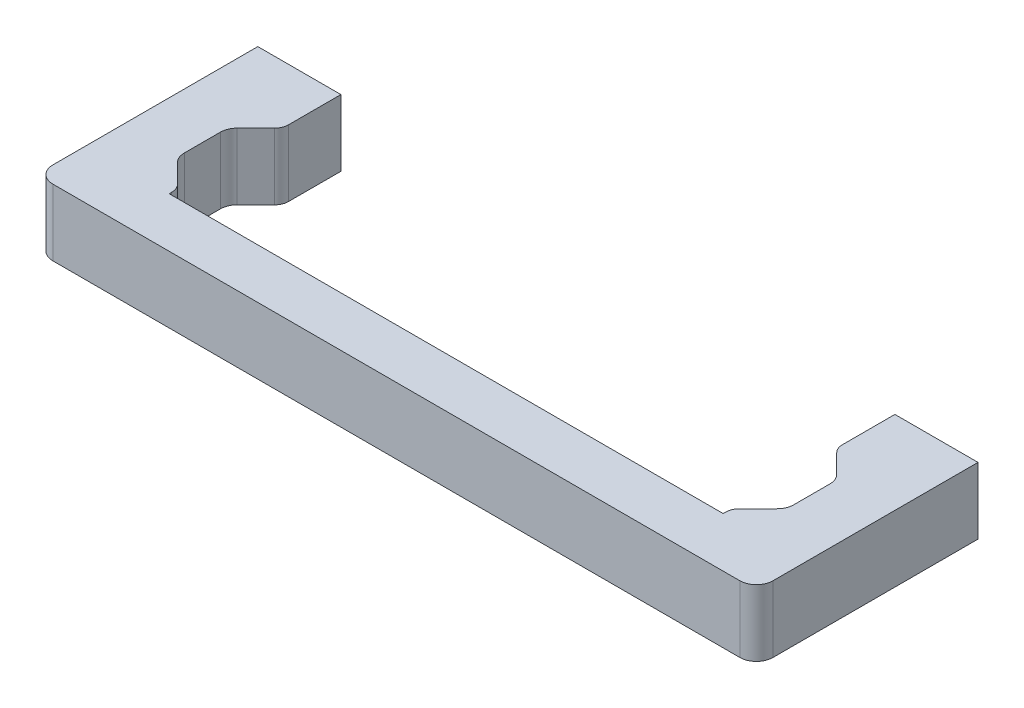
ISO-10303-21;
HEADER;
FILE_DESCRIPTION(('STEP AP214'),'2;1');
FILE_NAME('part.step','',(''),(''),'','','');
FILE_SCHEMA(('AUTOMOTIVE_DESIGN { 1 0 10303 214 1 1 1 1 }'));
ENDSEC;
DATA;
#1=APPLICATION_CONTEXT('core data for automotive mechanical design processes');
#2=APPLICATION_PROTOCOL_DEFINITION('international standard','automotive_design',2000,#1);
#3=PRODUCT_CONTEXT('',#1,'mechanical');
#4=PRODUCT('Part','Part','',(#3));
#5=PRODUCT_RELATED_PRODUCT_CATEGORY('part','',(#4));
#6=PRODUCT_DEFINITION_FORMATION('','',#4);
#7=PRODUCT_DEFINITION_CONTEXT('part definition',#1,'design');
#8=PRODUCT_DEFINITION('design','',#6,#7);
#9=PRODUCT_DEFINITION_SHAPE('','',#8);
#10=(LENGTH_UNIT() NAMED_UNIT(*) SI_UNIT(.MILLI.,.METRE.));
#11=(NAMED_UNIT(*) PLANE_ANGLE_UNIT() SI_UNIT($,.RADIAN.));
#12=(NAMED_UNIT(*) SI_UNIT($,.STERADIAN.) SOLID_ANGLE_UNIT());
#13=UNCERTAINTY_MEASURE_WITH_UNIT(LENGTH_MEASURE(1.E-05),#10,'distance_accuracy_value','');
#14=(GEOMETRIC_REPRESENTATION_CONTEXT(3) GLOBAL_UNCERTAINTY_ASSIGNED_CONTEXT((#13)) GLOBAL_UNIT_ASSIGNED_CONTEXT((#10,
#11,#12)) REPRESENTATION_CONTEXT('',''));
#15=CARTESIAN_POINT('',(0.,0.,0.));
#16=DIRECTION('',(0.,0.,1.));
#17=DIRECTION('',(1.,0.,0.));
#18=AXIS2_PLACEMENT_3D('',#15,#16,#17);
#19=CARTESIAN_POINT('',(-1.99937500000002,-6.,36.998073));
#20=DIRECTION('',(0.,1.,0.));
#21=DIRECTION('',(-1.,0.,0.));
#22=AXIS2_PLACEMENT_3D('',#19,#20,#21);
#23=CYLINDRICAL_SURFACE('',#22,2.999844);
#24=DIRECTION('',(0.,1.,0.));
#25=VECTOR('',#24,1.);
#26=CARTESIAN_POINT('',(-4.999219,-6.,36.998073));
#27=LINE('',#26,#25);
#28=CARTESIAN_POINT('',(-4.999219,-6.,36.998073));
#29=VERTEX_POINT('',#28);
#30=CARTESIAN_POINT('',(-4.999219,6.,36.998073));
#31=VERTEX_POINT('',#30);
#32=EDGE_CURVE('E9',#29,#31,#27,.T.);
#33=ORIENTED_EDGE('',*,*,#32,.F.);
#34=CARTESIAN_POINT('',(-1.99937500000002,-6.,36.998073));
#35=DIRECTION('',(0.,-1.,0.));
#36=DIRECTION('',(1.,0.,0.));
#37=AXIS2_PLACEMENT_3D('',#34,#35,#36);
#38=CIRCLE('',#37,2.999844);
#39=CARTESIAN_POINT('',(-1.99937500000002,-6.,39.997917));
#40=VERTEX_POINT('',#39);
#41=EDGE_CURVE('E277',#40,#29,#38,.T.);
#42=ORIENTED_EDGE('',*,*,#41,.F.);
#43=DIRECTION('',(0.,1.,0.));
#44=VECTOR('',#43,1.);
#45=CARTESIAN_POINT('',(-1.99937500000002,-6.,39.997917));
#46=LINE('',#45,#44);
#47=CARTESIAN_POINT('',(-1.99937500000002,6.,39.997917));
#48=VERTEX_POINT('',#47);
#49=EDGE_CURVE('E29',#40,#48,#46,.T.);
#50=ORIENTED_EDGE('',*,*,#49,.T.);
#51=CARTESIAN_POINT('',(-1.99937500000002,6.,36.998073));
#52=DIRECTION('',(0.,-1.,0.));
#53=DIRECTION('',(1.,0.,0.));
#54=AXIS2_PLACEMENT_3D('',#51,#52,#53);
#55=CIRCLE('',#54,2.999844);
#56=EDGE_CURVE('E197',#48,#31,#55,.T.);
#57=ORIENTED_EDGE('',*,*,#56,.T.);
#58=EDGE_LOOP('',(#33,#42,#50,#57));
#59=FACE_BOUND('',#58,.T.);
#60=ADVANCED_FACE('F14',(#59),#23,.T.);
#61=CARTESIAN_POINT('',(-4.999219,-6.,36.998073));
#62=DIRECTION('',(1.,0.,0.));
#63=DIRECTION('',(0.,1.,0.));
#64=AXIS2_PLACEMENT_3D('',#61,#62,#63);
#65=PLANE('',#64);
#66=DIRECTION('',(0.,1.,0.));
#67=VECTOR('',#66,1.);
#68=CARTESIAN_POINT('',(-4.999219,-6.,0.));
#69=LINE('',#68,#67);
#70=CARTESIAN_POINT('',(-4.999219,-6.,0.));
#71=VERTEX_POINT('',#70);
#72=CARTESIAN_POINT('',(-4.999219,6.,0.));
#73=VERTEX_POINT('',#72);
#74=EDGE_CURVE('E22',#71,#73,#69,.T.);
#75=ORIENTED_EDGE('',*,*,#74,.F.);
#76=DIRECTION('',(0.,0.,-1.));
#77=VECTOR('',#76,1.);
#78=CARTESIAN_POINT('',(-4.999219,-6.,36.998073));
#79=LINE('',#78,#77);
#80=EDGE_CURVE('E193',#29,#71,#79,.T.);
#81=ORIENTED_EDGE('',*,*,#80,.F.);
#82=ORIENTED_EDGE('',*,*,#32,.T.);
#83=DIRECTION('',(0.,0.,-1.));
#84=VECTOR('',#83,1.);
#85=CARTESIAN_POINT('',(-4.999219,6.,36.998073));
#86=LINE('',#85,#84);
#87=EDGE_CURVE('E190',#31,#73,#86,.T.);
#88=ORIENTED_EDGE('',*,*,#87,.T.);
#89=EDGE_LOOP('',(#75,#81,#82,#88));
#90=FACE_BOUND('',#89,.T.);
#91=ADVANCED_FACE('F16',(#90),#65,.F.);
#92=CARTESIAN_POINT('',(-4.999219,-6.,0.));
#93=DIRECTION('',(0.,0.,1.));
#94=DIRECTION('',(0.,-1.,0.));
#95=AXIS2_PLACEMENT_3D('',#92,#93,#94);
#96=PLANE('',#95);
#97=CARTESIAN_POINT('',(0.,0.,0.));
#98=DIRECTION('',(0.,0.,-1.));
#99=DIRECTION('',(0.,1.,0.));
#100=AXIS2_PLACEMENT_3D('',#97,#98,#99);
#101=CIRCLE('',#100,2.5);
#102=CARTESIAN_POINT('',(0.,2.5,0.));
#103=VERTEX_POINT('',#102);
#104=EDGE_CURVE('E763',#103,#103,#101,.T.);
#105=ORIENTED_EDGE('',*,*,#104,.F.);
#106=EDGE_LOOP('',(#105));
#107=FACE_BOUND('',#106,.T.);
#108=DIRECTION('',(0.,1.,0.));
#109=VECTOR('',#108,1.);
#110=CARTESIAN_POINT('',(10.,-6.,0.));
#111=LINE('',#110,#109);
#112=CARTESIAN_POINT('',(10.,-6.,0.));
#113=VERTEX_POINT('',#112);
#114=CARTESIAN_POINT('',(10.,6.,0.));
#115=VERTEX_POINT('',#114);
#116=EDGE_CURVE('E394',#113,#115,#111,.T.);
#117=ORIENTED_EDGE('',*,*,#116,.F.);
#118=DIRECTION('',(1.,0.,0.));
#119=VECTOR('',#118,1.);
#120=CARTESIAN_POINT('',(-4.999219,-6.,0.));
#121=LINE('',#120,#119);
#122=EDGE_CURVE('E280',#71,#113,#121,.T.);
#123=ORIENTED_EDGE('',*,*,#122,.F.);
#124=ORIENTED_EDGE('',*,*,#74,.T.);
#125=DIRECTION('',(1.,0.,0.));
#126=VECTOR('',#125,1.);
#127=CARTESIAN_POINT('',(-4.999219,6.,0.));
#128=LINE('',#127,#126);
#129=EDGE_CURVE('E205',#73,#115,#128,.T.);
#130=ORIENTED_EDGE('',*,*,#129,.T.);
#131=EDGE_LOOP('',(#117,#123,#124,#130));
#132=FACE_BOUND('',#131,.T.);
#133=ADVANCED_FACE('F397',(#107,#132),#96,.F.);
#134=CARTESIAN_POINT('',(10.,-6.,0.));
#135=DIRECTION('',(-1.,0.,0.));
#136=DIRECTION('',(0.,0.,-1.));
#137=AXIS2_PLACEMENT_3D('',#134,#135,#136);
#138=PLANE('',#137);
#139=DIRECTION('',(0.,1.,0.));
#140=VECTOR('',#139,1.);
#141=CARTESIAN_POINT('',(10.,-6.,9.463973));
#142=LINE('',#141,#140);
#143=CARTESIAN_POINT('',(10.,-6.,9.463973));
#144=VERTEX_POINT('',#143);
#145=CARTESIAN_POINT('',(10.,6.,9.463973));
#146=VERTEX_POINT('',#145);
#147=EDGE_CURVE('E392',#144,#146,#142,.T.);
#148=ORIENTED_EDGE('',*,*,#147,.F.);
#149=DIRECTION('',(0.,0.,1.));
#150=VECTOR('',#149,1.);
#151=CARTESIAN_POINT('',(10.,-6.,0.));
#152=LINE('',#151,#150);
#153=EDGE_CURVE('E283',#113,#144,#152,.T.);
#154=ORIENTED_EDGE('',*,*,#153,.F.);
#155=ORIENTED_EDGE('',*,*,#116,.T.);
#156=DIRECTION('',(0.,0.,1.));
#157=VECTOR('',#156,1.);
#158=CARTESIAN_POINT('',(10.,6.,0.));
#159=LINE('',#158,#157);
#160=EDGE_CURVE('E207',#115,#146,#159,.T.);
#161=ORIENTED_EDGE('',*,*,#160,.T.);
#162=EDGE_LOOP('',(#148,#154,#155,#161));
#163=FACE_BOUND('',#162,.T.);
#164=ADVANCED_FACE('F486',(#163),#138,.F.);
#165=CARTESIAN_POINT('',(7.50013,-6.,9.463973));
#166=DIRECTION('',(0.,1.,0.));
#167=DIRECTION('',(-1.,0.,0.));
#168=AXIS2_PLACEMENT_3D('',#165,#166,#167);
#169=CYLINDRICAL_SURFACE('',#168,2.49987);
#170=DIRECTION('',(0.,1.,0.));
#171=VECTOR('',#170,1.);
#172=CARTESIAN_POINT('',(9.26780502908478,-6.,11.2316480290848));
#173=LINE('',#172,#171);
#174=CARTESIAN_POINT('',(9.26780502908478,-6.,11.2316480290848));
#175=VERTEX_POINT('',#174);
#176=CARTESIAN_POINT('',(9.26780502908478,6.,11.2316480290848));
#177=VERTEX_POINT('',#176);
#178=EDGE_CURVE('E390',#175,#177,#173,.T.);
#179=ORIENTED_EDGE('',*,*,#178,.F.);
#180=CARTESIAN_POINT('',(7.50013,-6.,9.463973));
#181=DIRECTION('',(0.,-1.,0.));
#182=DIRECTION('',(1.,0.,0.));
#183=AXIS2_PLACEMENT_3D('',#180,#181,#182);
#184=CIRCLE('',#183,2.49987);
#185=EDGE_CURVE('E286',#144,#175,#184,.T.);
#186=ORIENTED_EDGE('',*,*,#185,.F.);
#187=ORIENTED_EDGE('',*,*,#147,.T.);
#188=CARTESIAN_POINT('',(7.50013,6.,9.463973));
#189=DIRECTION('',(0.,-1.,0.));
#190=DIRECTION('',(1.,0.,0.));
#191=AXIS2_PLACEMENT_3D('',#188,#189,#190);
#192=CIRCLE('',#191,2.49987);
#193=EDGE_CURVE('E213',#146,#177,#192,.T.);
#194=ORIENTED_EDGE('',*,*,#193,.T.);
#195=EDGE_LOOP('',(#179,#186,#187,#194));
#196=FACE_BOUND('',#195,.T.);
#197=ADVANCED_FACE('F484',(#196),#169,.T.);
#198=CARTESIAN_POINT('',(5.87889396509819,-6.,14.6205589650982));
#199=DIRECTION('',(0.707106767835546,0.,0.707106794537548));
#200=DIRECTION('',(-0.707106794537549,0.,0.707106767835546));
#201=AXIS2_PLACEMENT_3D('',#198,#199,#200);
#202=PLANE('',#201);
#203=DIRECTION('',(0.,1.,0.));
#204=VECTOR('',#203,1.);
#205=CARTESIAN_POINT('',(5.87889396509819,-6.,14.6205589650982));
#206=LINE('',#205,#204);
#207=CARTESIAN_POINT('',(5.87889396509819,-6.,14.6205589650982));
#208=VERTEX_POINT('',#207);
#209=CARTESIAN_POINT('',(5.87889396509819,6.,14.6205589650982));
#210=VERTEX_POINT('',#209);
#211=EDGE_CURVE('E388',#208,#210,#206,.T.);
#212=ORIENTED_EDGE('',*,*,#211,.F.);
#213=DIRECTION('',(0.707106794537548,0.,-0.707106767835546));
#214=VECTOR('',#213,1.);
#215=CARTESIAN_POINT('',(5.87889396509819,-6.,14.6205589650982));
#216=LINE('',#215,#214);
#217=EDGE_CURVE('E289',#208,#175,#216,.T.);
#218=ORIENTED_EDGE('',*,*,#217,.T.);
#219=ORIENTED_EDGE('',*,*,#178,.T.);
#220=DIRECTION('',(0.707106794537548,0.,-0.707106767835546));
#221=VECTOR('',#220,1.);
#222=CARTESIAN_POINT('',(5.87889396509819,6.,14.6205589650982));
#223=LINE('',#222,#221);
#224=EDGE_CURVE('E216',#210,#177,#223,.T.);
#225=ORIENTED_EDGE('',*,*,#224,.F.);
#226=EDGE_LOOP('',(#212,#218,#219,#225));
#227=FACE_BOUND('',#226,.T.);
#228=ADVANCED_FACE('F480',(#227),#202,.T.);
#229=CARTESIAN_POINT('',(8.000104,-6.,16.741769));
#230=DIRECTION('',(0.,1.,0.));
#231=DIRECTION('',(-1.,0.,0.));
#232=AXIS2_PLACEMENT_3D('',#229,#230,#231);
#233=CYLINDRICAL_SURFACE('',#232,2.999844);
#234=DIRECTION('',(0.,1.,0.));
#235=VECTOR('',#234,1.);
#236=CARTESIAN_POINT('',(5.00026,-6.,16.741769));
#237=LINE('',#236,#235);
#238=CARTESIAN_POINT('',(5.00026,-6.,16.741769));
#239=VERTEX_POINT('',#238);
#240=CARTESIAN_POINT('',(5.00026,6.,16.741769));
#241=VERTEX_POINT('',#240);
#242=EDGE_CURVE('E386',#239,#241,#237,.T.);
#243=ORIENTED_EDGE('',*,*,#242,.F.);
#244=CARTESIAN_POINT('',(8.000104,-6.,16.741769));
#245=DIRECTION('',(0.,-1.,0.));
#246=DIRECTION('',(1.,0.,0.));
#247=AXIS2_PLACEMENT_3D('',#244,#245,#246);
#248=CIRCLE('',#247,2.999844);
#249=EDGE_CURVE('E292',#239,#208,#248,.T.);
#250=ORIENTED_EDGE('',*,*,#249,.T.);
#251=ORIENTED_EDGE('',*,*,#211,.T.);
#252=CARTESIAN_POINT('',(8.000104,6.,16.741769));
#253=DIRECTION('',(0.,-1.,0.));
#254=DIRECTION('',(1.,0.,0.));
#255=AXIS2_PLACEMENT_3D('',#252,#253,#254);
#256=CIRCLE('',#255,2.999844);
#257=EDGE_CURVE('E219',#241,#210,#256,.T.);
#258=ORIENTED_EDGE('',*,*,#257,.F.);
#259=EDGE_LOOP('',(#243,#250,#251,#258));
#260=FACE_BOUND('',#259,.T.);
#261=ADVANCED_FACE('F476',(#260),#233,.F.);
#262=CARTESIAN_POINT('',(5.00026,-6.,23.256148));
#263=DIRECTION('',(1.,0.,0.));
#264=DIRECTION('',(0.,1.,0.));
#265=AXIS2_PLACEMENT_3D('',#262,#263,#264);
#266=PLANE('',#265);
#267=DIRECTION('',(0.,1.,0.));
#268=VECTOR('',#267,1.);
#269=CARTESIAN_POINT('',(5.00026,-6.,23.256148));
#270=LINE('',#269,#268);
#271=CARTESIAN_POINT('',(5.00026,-6.,23.256148));
#272=VERTEX_POINT('',#271);
#273=CARTESIAN_POINT('',(5.00026,6.,23.256148));
#274=VERTEX_POINT('',#273);
#275=EDGE_CURVE('E384',#272,#274,#270,.T.);
#276=ORIENTED_EDGE('',*,*,#275,.F.);
#277=DIRECTION('',(0.,0.,-1.));
#278=VECTOR('',#277,1.);
#279=CARTESIAN_POINT('',(5.00026,-6.,23.256148));
#280=LINE('',#279,#278);
#281=EDGE_CURVE('E295',#272,#239,#280,.T.);
#282=ORIENTED_EDGE('',*,*,#281,.T.);
#283=ORIENTED_EDGE('',*,*,#242,.T.);
#284=DIRECTION('',(0.,0.,-1.));
#285=VECTOR('',#284,1.);
#286=CARTESIAN_POINT('',(5.00026,6.,23.256148));
#287=LINE('',#286,#285);
#288=EDGE_CURVE('E222',#274,#241,#287,.T.);
#289=ORIENTED_EDGE('',*,*,#288,.F.);
#290=EDGE_LOOP('',(#276,#282,#283,#289));
#291=FACE_BOUND('',#290,.T.);
#292=ADVANCED_FACE('F472',(#291),#266,.T.);
#293=CARTESIAN_POINT('',(8.000104,-6.,23.256148));
#294=DIRECTION('',(0.,1.,0.));
#295=DIRECTION('',(-1.,0.,0.));
#296=AXIS2_PLACEMENT_3D('',#293,#294,#295);
#297=CYLINDRICAL_SURFACE('',#296,2.999844);
#298=DIRECTION('',(0.,1.,0.));
#299=VECTOR('',#298,1.);
#300=CARTESIAN_POINT('',(5.87889396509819,-6.,25.3773580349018));
#301=LINE('',#300,#299);
#302=CARTESIAN_POINT('',(5.87889396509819,-6.,25.3773580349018));
#303=VERTEX_POINT('',#302);
#304=CARTESIAN_POINT('',(5.87889396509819,6.,25.3773580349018));
#305=VERTEX_POINT('',#304);
#306=EDGE_CURVE('E382',#303,#305,#301,.T.);
#307=ORIENTED_EDGE('',*,*,#306,.F.);
#308=CARTESIAN_POINT('',(8.000104,-6.,23.256148));
#309=DIRECTION('',(0.,-1.,0.));
#310=DIRECTION('',(1.,0.,0.));
#311=AXIS2_PLACEMENT_3D('',#308,#309,#310);
#312=CIRCLE('',#311,2.999844);
#313=EDGE_CURVE('E298',#303,#272,#312,.T.);
#314=ORIENTED_EDGE('',*,*,#313,.T.);
#315=ORIENTED_EDGE('',*,*,#275,.T.);
#316=CARTESIAN_POINT('',(8.000104,6.,23.256148));
#317=DIRECTION('',(0.,-1.,0.));
#318=DIRECTION('',(1.,0.,0.));
#319=AXIS2_PLACEMENT_3D('',#316,#317,#318);
#320=CIRCLE('',#319,2.999844);
#321=EDGE_CURVE('E225',#305,#274,#320,.T.);
#322=ORIENTED_EDGE('',*,*,#321,.F.);
#323=EDGE_LOOP('',(#307,#314,#315,#322));
#324=FACE_BOUND('',#323,.T.);
#325=ADVANCED_FACE('F468',(#324),#297,.F.);
#326=CARTESIAN_POINT('',(5.87889396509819,-6.,25.3773580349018));
#327=DIRECTION('',(-0.707106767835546,0.,0.707106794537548));
#328=DIRECTION('',(-0.707106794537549,0.,-0.707106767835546));
#329=AXIS2_PLACEMENT_3D('',#326,#327,#328);
#330=PLANE('',#329);
#331=DIRECTION('',(0.,1.,0.));
#332=VECTOR('',#331,1.);
#333=CARTESIAN_POINT('',(9.26780502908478,-6.,28.7662689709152));
#334=LINE('',#333,#332);
#335=CARTESIAN_POINT('',(9.26780502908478,-6.,28.7662689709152));
#336=VERTEX_POINT('',#335);
#337=CARTESIAN_POINT('',(9.26780502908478,6.,28.7662689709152));
#338=VERTEX_POINT('',#337);
#339=EDGE_CURVE('E380',#336,#338,#334,.T.);
#340=ORIENTED_EDGE('',*,*,#339,.F.);
#341=DIRECTION('',(0.707106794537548,0.,0.707106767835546));
#342=VECTOR('',#341,1.);
#343=CARTESIAN_POINT('',(5.87889396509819,-6.,25.3773580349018));
#344=LINE('',#343,#342);
#345=EDGE_CURVE('E301',#303,#336,#344,.T.);
#346=ORIENTED_EDGE('',*,*,#345,.F.);
#347=ORIENTED_EDGE('',*,*,#306,.T.);
#348=DIRECTION('',(0.707106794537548,0.,0.707106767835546));
#349=VECTOR('',#348,1.);
#350=CARTESIAN_POINT('',(5.87889396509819,6.,25.3773580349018));
#351=LINE('',#350,#349);
#352=EDGE_CURVE('E228',#305,#338,#351,.T.);
#353=ORIENTED_EDGE('',*,*,#352,.T.);
#354=EDGE_LOOP('',(#340,#346,#347,#353));
#355=FACE_BOUND('',#354,.T.);
#356=ADVANCED_FACE('F464',(#355),#330,.F.);
#357=CARTESIAN_POINT('',(7.50013,-6.,30.533944));
#358=DIRECTION('',(0.,1.,0.));
#359=DIRECTION('',(-1.,0.,0.));
#360=AXIS2_PLACEMENT_3D('',#357,#358,#359);
#361=CYLINDRICAL_SURFACE('',#360,2.49987);
#362=DIRECTION('',(0.,1.,0.));
#363=VECTOR('',#362,1.);
#364=CARTESIAN_POINT('',(10.,-6.,30.533944));
#365=LINE('',#364,#363);
#366=CARTESIAN_POINT('',(10.,-6.,30.533944));
#367=VERTEX_POINT('',#366);
#368=CARTESIAN_POINT('',(10.,6.,30.533944));
#369=VERTEX_POINT('',#368);
#370=EDGE_CURVE('E378',#367,#369,#365,.T.);
#371=ORIENTED_EDGE('',*,*,#370,.F.);
#372=CARTESIAN_POINT('',(7.50013,-6.,30.533944));
#373=DIRECTION('',(0.,-1.,0.));
#374=DIRECTION('',(1.,0.,0.));
#375=AXIS2_PLACEMENT_3D('',#372,#373,#374);
#376=CIRCLE('',#375,2.49987);
#377=EDGE_CURVE('E304',#336,#367,#376,.T.);
#378=ORIENTED_EDGE('',*,*,#377,.F.);
#379=ORIENTED_EDGE('',*,*,#339,.T.);
#380=CARTESIAN_POINT('',(7.50013,6.,30.533944));
#381=DIRECTION('',(0.,-1.,0.));
#382=DIRECTION('',(1.,0.,0.));
#383=AXIS2_PLACEMENT_3D('',#380,#381,#382);
#384=CIRCLE('',#383,2.49987);
#385=EDGE_CURVE('E231',#338,#369,#384,.T.);
#386=ORIENTED_EDGE('',*,*,#385,.T.);
#387=EDGE_LOOP('',(#371,#378,#379,#386));
#388=FACE_BOUND('',#387,.T.);
#389=ADVANCED_FACE('F461',(#388),#361,.T.);
#390=CARTESIAN_POINT('',(10.,-6.,30.533944));
#391=DIRECTION('',(-1.,0.,0.));
#392=DIRECTION('',(0.,0.,-1.));
#393=AXIS2_PLACEMENT_3D('',#390,#391,#392);
#394=PLANE('',#393);
#395=DIRECTION('',(0.,1.,0.));
#396=VECTOR('',#395,1.);
#397=CARTESIAN_POINT('',(10.,-6.,30.998386));
#398=LINE('',#397,#396);
#399=CARTESIAN_POINT('',(10.,-6.,30.998386));
#400=VERTEX_POINT('',#399);
#401=CARTESIAN_POINT('',(10.,6.,30.998386));
#402=VERTEX_POINT('',#401);
#403=EDGE_CURVE('E376',#400,#402,#398,.T.);
#404=ORIENTED_EDGE('',*,*,#403,.F.);
#405=DIRECTION('',(0.,0.,1.));
#406=VECTOR('',#405,1.);
#407=CARTESIAN_POINT('',(10.,-6.,30.533944));
#408=LINE('',#407,#406);
#409=EDGE_CURVE('E307',#367,#400,#408,.T.);
#410=ORIENTED_EDGE('',*,*,#409,.F.);
#411=ORIENTED_EDGE('',*,*,#370,.T.);
#412=DIRECTION('',(0.,0.,1.));
#413=VECTOR('',#412,1.);
#414=CARTESIAN_POINT('',(10.,6.,30.533944));
#415=LINE('',#414,#413);
#416=EDGE_CURVE('E234',#369,#402,#415,.T.);
#417=ORIENTED_EDGE('',*,*,#416,.T.);
#418=EDGE_LOOP('',(#404,#410,#411,#417));
#419=FACE_BOUND('',#418,.T.);
#420=ADVANCED_FACE('F457',(#419),#394,.F.);
#421=CARTESIAN_POINT('',(10.,-6.,30.998386));
#422=DIRECTION('',(0.,0.,1.));
#423=DIRECTION('',(0.,-1.,0.));
#424=AXIS2_PLACEMENT_3D('',#421,#422,#423);
#425=PLANE('',#424);
#426=DIRECTION('',(0.,1.,0.));
#427=VECTOR('',#426,1.);
#428=CARTESIAN_POINT('',(110.001562,-6.,30.998386));
#429=LINE('',#428,#427);
#430=CARTESIAN_POINT('',(110.001562,-6.,30.998386));
#431=VERTEX_POINT('',#430);
#432=CARTESIAN_POINT('',(110.001562,6.,30.998386));
#433=VERTEX_POINT('',#432);
#434=EDGE_CURVE('E374',#431,#433,#429,.T.);
#435=ORIENTED_EDGE('',*,*,#434,.F.);
#436=DIRECTION('',(1.,0.,0.));
#437=VECTOR('',#436,1.);
#438=CARTESIAN_POINT('',(10.,-6.,30.998386));
#439=LINE('',#438,#437);
#440=EDGE_CURVE('E310',#400,#431,#439,.T.);
#441=ORIENTED_EDGE('',*,*,#440,.F.);
#442=ORIENTED_EDGE('',*,*,#403,.T.);
#443=DIRECTION('',(1.,0.,0.));
#444=VECTOR('',#443,1.);
#445=CARTESIAN_POINT('',(10.,6.,30.998386));
#446=LINE('',#445,#444);
#447=EDGE_CURVE('E237',#402,#433,#446,.T.);
#448=ORIENTED_EDGE('',*,*,#447,.T.);
#449=EDGE_LOOP('',(#435,#441,#442,#448));
#450=FACE_BOUND('',#449,.T.);
#451=ADVANCED_FACE('F452',(#450),#425,.F.);
#452=CARTESIAN_POINT('',(110.001562,-6.,30.533944));
#453=DIRECTION('',(-1.,0.,0.));
#454=DIRECTION('',(0.,-1.,0.));
#455=AXIS2_PLACEMENT_3D('',#452,#453,#454);
#456=PLANE('',#455);
#457=DIRECTION('',(0.,1.,0.));
#458=VECTOR('',#457,1.);
#459=CARTESIAN_POINT('',(110.001562,-6.,30.533944));
#460=LINE('',#459,#458);
#461=CARTESIAN_POINT('',(110.001562,-6.,30.533944));
#462=VERTEX_POINT('',#461);
#463=CARTESIAN_POINT('',(110.001562,6.,30.533944));
#464=VERTEX_POINT('',#463);
#465=EDGE_CURVE('E372',#462,#464,#460,.T.);
#466=ORIENTED_EDGE('',*,*,#465,.F.);
#467=DIRECTION('',(0.,0.,1.));
#468=VECTOR('',#467,1.);
#469=CARTESIAN_POINT('',(110.001562,-6.,30.533944));
#470=LINE('',#469,#468);
#471=EDGE_CURVE('E313',#462,#431,#470,.T.);
#472=ORIENTED_EDGE('',*,*,#471,.T.);
#473=ORIENTED_EDGE('',*,*,#434,.T.);
#474=DIRECTION('',(0.,0.,1.));
#475=VECTOR('',#474,1.);
#476=CARTESIAN_POINT('',(110.001562,6.,30.533944));
#477=LINE('',#476,#475);
#478=EDGE_CURVE('E240',#464,#433,#477,.T.);
#479=ORIENTED_EDGE('',*,*,#478,.F.);
#480=EDGE_LOOP('',(#466,#472,#473,#479));
#481=FACE_BOUND('',#480,.T.);
#482=ADVANCED_FACE('F449',(#481),#456,.T.);
#483=CARTESIAN_POINT('',(112.501432,-6.,30.533944));
#484=DIRECTION('',(0.,1.,0.));
#485=DIRECTION('',(-1.,0.,0.));
#486=AXIS2_PLACEMENT_3D('',#483,#484,#485);
#487=CYLINDRICAL_SURFACE('',#486,2.49986997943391);
#488=DIRECTION('',(0.,1.,0.));
#489=VECTOR('',#488,1.);
#490=CARTESIAN_POINT('',(110.733756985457,-6.,28.7662689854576));
#491=LINE('',#490,#489);
#492=CARTESIAN_POINT('',(110.733756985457,-6.,28.7662689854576));
#493=VERTEX_POINT('',#492);
#494=CARTESIAN_POINT('',(110.733756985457,6.,28.7662689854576));
#495=VERTEX_POINT('',#494);
#496=EDGE_CURVE('E370',#493,#495,#491,.T.);
#497=ORIENTED_EDGE('',*,*,#496,.F.);
#498=CARTESIAN_POINT('',(112.501432,-6.,30.533944));
#499=DIRECTION('',(0.,-1.,0.));
#500=DIRECTION('',(1.,0.,0.));
#501=AXIS2_PLACEMENT_3D('',#498,#499,#500);
#502=CIRCLE('',#501,2.49986997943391);
#503=EDGE_CURVE('E316',#462,#493,#502,.T.);
#504=ORIENTED_EDGE('',*,*,#503,.F.);
#505=ORIENTED_EDGE('',*,*,#465,.T.);
#506=CARTESIAN_POINT('',(112.501432,6.,30.533944));
#507=DIRECTION('',(0.,-1.,0.));
#508=DIRECTION('',(1.,0.,0.));
#509=AXIS2_PLACEMENT_3D('',#506,#507,#508);
#510=CIRCLE('',#509,2.49986997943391);
#511=EDGE_CURVE('E243',#464,#495,#510,.T.);
#512=ORIENTED_EDGE('',*,*,#511,.T.);
#513=EDGE_LOOP('',(#497,#504,#505,#512));
#514=FACE_BOUND('',#513,.T.);
#515=ADVANCED_FACE('F445',(#514),#487,.T.);
#516=CARTESIAN_POINT('',(114.122668,-6.,25.377358));
#517=DIRECTION('',(-0.707106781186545,0.,-0.70710678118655));
#518=DIRECTION('',(0.707106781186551,0.,-0.707106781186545));
#519=AXIS2_PLACEMENT_3D('',#516,#517,#518);
#520=PLANE('',#519);
#521=DIRECTION('',(0.,1.,0.));
#522=VECTOR('',#521,1.);
#523=CARTESIAN_POINT('',(114.122668,-6.,25.377358));
#524=LINE('',#523,#522);
#525=CARTESIAN_POINT('',(114.122668,-6.,25.377358));
#526=VERTEX_POINT('',#525);
#527=CARTESIAN_POINT('',(114.122668,6.,25.377358));
#528=VERTEX_POINT('',#527);
#529=EDGE_CURVE('E368',#526,#528,#524,.T.);
#530=ORIENTED_EDGE('',*,*,#529,.F.);
#531=DIRECTION('',(-0.707106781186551,0.,0.707106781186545));
#532=VECTOR('',#531,1.);
#533=CARTESIAN_POINT('',(114.122668,-6.,25.377358));
#534=LINE('',#533,#532);
#535=EDGE_CURVE('E319',#526,#493,#534,.T.);
#536=ORIENTED_EDGE('',*,*,#535,.T.);
#537=ORIENTED_EDGE('',*,*,#496,.T.);
#538=DIRECTION('',(-0.707106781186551,0.,0.707106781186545));
#539=VECTOR('',#538,1.);
#540=CARTESIAN_POINT('',(114.122668,6.,25.377358));
#541=LINE('',#540,#539);
#542=EDGE_CURVE('E246',#528,#495,#541,.T.);
#543=ORIENTED_EDGE('',*,*,#542,.F.);
#544=EDGE_LOOP('',(#530,#536,#537,#543));
#545=FACE_BOUND('',#544,.T.);
#546=ADVANCED_FACE('F440',(#545),#520,.T.);
#547=CARTESIAN_POINT('',(112.001458,-6.,23.256148));
#548=DIRECTION('',(0.,1.,0.));
#549=DIRECTION('',(-1.,0.,0.));
#550=AXIS2_PLACEMENT_3D('',#547,#548,#549);
#551=CYLINDRICAL_SURFACE('',#550,2.99984397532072);
#552=DIRECTION('',(0.,1.,0.));
#553=VECTOR('',#552,1.);
#554=CARTESIAN_POINT('',(115.001301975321,-6.,23.256148));
#555=LINE('',#554,#553);
#556=CARTESIAN_POINT('',(115.001301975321,-6.,23.256148));
#557=VERTEX_POINT('',#556);
#558=CARTESIAN_POINT('',(115.001301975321,6.,23.256148));
#559=VERTEX_POINT('',#558);
#560=EDGE_CURVE('E366',#557,#559,#555,.T.);
#561=ORIENTED_EDGE('',*,*,#560,.F.);
#562=CARTESIAN_POINT('',(112.001458,-6.,23.256148));
#563=DIRECTION('',(0.,-1.,0.));
#564=DIRECTION('',(1.,0.,0.));
#565=AXIS2_PLACEMENT_3D('',#562,#563,#564);
#566=CIRCLE('',#565,2.99984397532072);
#567=EDGE_CURVE('E322',#557,#526,#566,.T.);
#568=ORIENTED_EDGE('',*,*,#567,.T.);
#569=ORIENTED_EDGE('',*,*,#529,.T.);
#570=CARTESIAN_POINT('',(112.001458,6.,23.256148));
#571=DIRECTION('',(0.,-1.,0.));
#572=DIRECTION('',(1.,0.,0.));
#573=AXIS2_PLACEMENT_3D('',#570,#571,#572);
#574=CIRCLE('',#573,2.99984397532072);
#575=EDGE_CURVE('E249',#559,#528,#574,.T.);
#576=ORIENTED_EDGE('',*,*,#575,.F.);
#577=EDGE_LOOP('',(#561,#568,#569,#576));
#578=FACE_BOUND('',#577,.T.);
#579=ADVANCED_FACE('F436',(#578),#551,.F.);
#580=CARTESIAN_POINT('',(115.001302,-6.,23.256148));
#581=DIRECTION('',(1.,0.,0.));
#582=DIRECTION('',(0.,1.,0.));
#583=AXIS2_PLACEMENT_3D('',#580,#581,#582);
#584=PLANE('',#583);
#585=DIRECTION('',(0.,1.,0.));
#586=VECTOR('',#585,1.);
#587=CARTESIAN_POINT('',(115.001302,-6.,16.741769));
#588=LINE('',#587,#586);
#589=CARTESIAN_POINT('',(115.001302,-6.,16.741769));
#590=VERTEX_POINT('',#589);
#591=CARTESIAN_POINT('',(115.001302,6.,16.741769));
#592=VERTEX_POINT('',#591);
#593=EDGE_CURVE('E364',#590,#592,#588,.T.);
#594=ORIENTED_EDGE('',*,*,#593,.F.);
#595=DIRECTION('',(0.,0.,-1.));
#596=VECTOR('',#595,1.);
#597=CARTESIAN_POINT('',(115.001302,-6.,23.256148));
#598=LINE('',#597,#596);
#599=EDGE_CURVE('E325',#557,#590,#598,.T.);
#600=ORIENTED_EDGE('',*,*,#599,.F.);
#601=ORIENTED_EDGE('',*,*,#560,.T.);
#602=DIRECTION('',(0.,0.,-1.));
#603=VECTOR('',#602,1.);
#604=CARTESIAN_POINT('',(115.001302,6.,23.256148));
#605=LINE('',#604,#603);
#606=EDGE_CURVE('E252',#559,#592,#605,.T.);
#607=ORIENTED_EDGE('',*,*,#606,.T.);
#608=EDGE_LOOP('',(#594,#600,#601,#607));
#609=FACE_BOUND('',#608,.T.);
#610=ADVANCED_FACE('F432',(#609),#584,.F.);
#611=CARTESIAN_POINT('',(112.001458,-6.,16.741769));
#612=DIRECTION('',(0.,1.,0.));
#613=DIRECTION('',(-1.,0.,0.));
#614=AXIS2_PLACEMENT_3D('',#611,#612,#613);
#615=CYLINDRICAL_SURFACE('',#614,2.99984397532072);
#616=DIRECTION('',(0.,1.,0.));
#617=VECTOR('',#616,1.);
#618=CARTESIAN_POINT('',(114.122668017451,-6.,14.620558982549));
#619=LINE('',#618,#617);
#620=CARTESIAN_POINT('',(114.122668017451,-6.,14.620558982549));
#621=VERTEX_POINT('',#620);
#622=CARTESIAN_POINT('',(114.122668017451,6.,14.620558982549));
#623=VERTEX_POINT('',#622);
#624=EDGE_CURVE('E362',#621,#623,#619,.T.);
#625=ORIENTED_EDGE('',*,*,#624,.F.);
#626=CARTESIAN_POINT('',(112.001458,-6.,16.741769));
#627=DIRECTION('',(0.,-1.,0.));
#628=DIRECTION('',(1.,0.,0.));
#629=AXIS2_PLACEMENT_3D('',#626,#627,#628);
#630=CIRCLE('',#629,2.99984397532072);
#631=EDGE_CURVE('E328',#621,#590,#630,.T.);
#632=ORIENTED_EDGE('',*,*,#631,.T.);
#633=ORIENTED_EDGE('',*,*,#593,.T.);
#634=CARTESIAN_POINT('',(112.001458,6.,16.741769));
#635=DIRECTION('',(0.,-1.,0.));
#636=DIRECTION('',(1.,0.,0.));
#637=AXIS2_PLACEMENT_3D('',#634,#635,#636);
#638=CIRCLE('',#637,2.99984397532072);
#639=EDGE_CURVE('E255',#623,#592,#638,.T.);
#640=ORIENTED_EDGE('',*,*,#639,.F.);
#641=EDGE_LOOP('',(#625,#632,#633,#640));
#642=FACE_BOUND('',#641,.T.);
#643=ADVANCED_FACE('F428',(#642),#615,.F.);
#644=CARTESIAN_POINT('',(114.122668,-6.,14.620559));
#645=DIRECTION('',(0.707106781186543,0.,-0.707106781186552));
#646=DIRECTION('',(0.707106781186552,0.,0.707106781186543));
#647=AXIS2_PLACEMENT_3D('',#644,#645,#646);
#648=PLANE('',#647);
#649=DIRECTION('',(0.,1.,0.));
#650=VECTOR('',#649,1.);
#651=CARTESIAN_POINT('',(110.733757,-6.,11.231648));
#652=LINE('',#651,#650);
#653=CARTESIAN_POINT('',(110.733757,-6.,11.231648));
#654=VERTEX_POINT('',#653);
#655=CARTESIAN_POINT('',(110.733757,6.,11.231648));
#656=VERTEX_POINT('',#655);
#657=EDGE_CURVE('E360',#654,#656,#652,.T.);
#658=ORIENTED_EDGE('',*,*,#657,.F.);
#659=DIRECTION('',(-0.707106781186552,0.,-0.707106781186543));
#660=VECTOR('',#659,1.);
#661=CARTESIAN_POINT('',(114.122668,-6.,14.620559));
#662=LINE('',#661,#660);
#663=EDGE_CURVE('E331',#621,#654,#662,.T.);
#664=ORIENTED_EDGE('',*,*,#663,.F.);
#665=ORIENTED_EDGE('',*,*,#624,.T.);
#666=DIRECTION('',(-0.707106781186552,0.,-0.707106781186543));
#667=VECTOR('',#666,1.);
#668=CARTESIAN_POINT('',(114.122668,6.,14.620559));
#669=LINE('',#668,#667);
#670=EDGE_CURVE('E258',#623,#656,#669,.T.);
#671=ORIENTED_EDGE('',*,*,#670,.T.);
#672=EDGE_LOOP('',(#658,#664,#665,#671));
#673=FACE_BOUND('',#672,.T.);
#674=ADVANCED_FACE('F424',(#673),#648,.F.);
#675=CARTESIAN_POINT('',(112.501432,-6.,9.463973));
#676=DIRECTION('',(0.,1.,0.));
#677=DIRECTION('',(-1.,0.,0.));
#678=AXIS2_PLACEMENT_3D('',#675,#676,#677);
#679=CYLINDRICAL_SURFACE('',#678,2.49986997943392);
#680=DIRECTION('',(0.,1.,0.));
#681=VECTOR('',#680,1.);
#682=CARTESIAN_POINT('',(110.001562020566,-6.,9.463973));
#683=LINE('',#682,#681);
#684=CARTESIAN_POINT('',(110.001562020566,-6.,9.463973));
#685=VERTEX_POINT('',#684);
#686=CARTESIAN_POINT('',(110.001562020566,6.,9.463973));
#687=VERTEX_POINT('',#686);
#688=EDGE_CURVE('E358',#685,#687,#683,.T.);
#689=ORIENTED_EDGE('',*,*,#688,.F.);
#690=CARTESIAN_POINT('',(112.501432,-6.,9.463973));
#691=DIRECTION('',(0.,-1.,0.));
#692=DIRECTION('',(1.,0.,0.));
#693=AXIS2_PLACEMENT_3D('',#690,#691,#692);
#694=CIRCLE('',#693,2.49986997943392);
#695=EDGE_CURVE('E334',#654,#685,#694,.T.);
#696=ORIENTED_EDGE('',*,*,#695,.F.);
#697=ORIENTED_EDGE('',*,*,#657,.T.);
#698=CARTESIAN_POINT('',(112.501432,6.,9.463973));
#699=DIRECTION('',(0.,-1.,0.));
#700=DIRECTION('',(1.,0.,0.));
#701=AXIS2_PLACEMENT_3D('',#698,#699,#700);
#702=CIRCLE('',#701,2.49986997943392);
#703=EDGE_CURVE('E261',#656,#687,#702,.T.);
#704=ORIENTED_EDGE('',*,*,#703,.T.);
#705=EDGE_LOOP('',(#689,#696,#697,#704));
#706=FACE_BOUND('',#705,.T.);
#707=ADVANCED_FACE('F420',(#706),#679,.T.);
#708=CARTESIAN_POINT('',(110.001562,-6.,0.));
#709=DIRECTION('',(-1.,0.,0.));
#710=DIRECTION('',(0.,-1.,0.));
#711=AXIS2_PLACEMENT_3D('',#708,#709,#710);
#712=PLANE('',#711);
#713=DIRECTION('',(0.,1.,0.));
#714=VECTOR('',#713,1.);
#715=CARTESIAN_POINT('',(110.001562,-6.,0.));
#716=LINE('',#715,#714);
#717=CARTESIAN_POINT('',(110.001562,-6.,0.));
#718=VERTEX_POINT('',#717);
#719=CARTESIAN_POINT('',(110.001562,6.,0.));
#720=VERTEX_POINT('',#719);
#721=EDGE_CURVE('E356',#718,#720,#716,.T.);
#722=ORIENTED_EDGE('',*,*,#721,.F.);
#723=DIRECTION('',(0.,0.,1.));
#724=VECTOR('',#723,1.);
#725=CARTESIAN_POINT('',(110.001562,-6.,0.));
#726=LINE('',#725,#724);
#727=EDGE_CURVE('E337',#718,#685,#726,.T.);
#728=ORIENTED_EDGE('',*,*,#727,.T.);
#729=ORIENTED_EDGE('',*,*,#688,.T.);
#730=DIRECTION('',(0.,0.,1.));
#731=VECTOR('',#730,1.);
#732=CARTESIAN_POINT('',(110.001562,6.,0.));
#733=LINE('',#732,#731);
#734=EDGE_CURVE('E264',#720,#687,#733,.T.);
#735=ORIENTED_EDGE('',*,*,#734,.F.);
#736=EDGE_LOOP('',(#722,#728,#729,#735));
#737=FACE_BOUND('',#736,.T.);
#738=ADVANCED_FACE('F416',(#737),#712,.T.);
#739=CARTESIAN_POINT('',(125.000781,-6.,0.));
#740=DIRECTION('',(0.,0.,-1.));
#741=DIRECTION('',(0.,1.,0.));
#742=AXIS2_PLACEMENT_3D('',#739,#740,#741);
#743=PLANE('',#742);
#744=CARTESIAN_POINT('',(120.001562,0.,0.));
#745=DIRECTION('',(0.,0.,-1.));
#746=DIRECTION('',(0.,1.,0.));
#747=AXIS2_PLACEMENT_3D('',#744,#745,#746);
#748=CIRCLE('',#747,2.5);
#749=CARTESIAN_POINT('',(120.001562,2.5,0.));
#750=VERTEX_POINT('',#749);
#751=EDGE_CURVE('E762',#750,#750,#748,.T.);
#752=ORIENTED_EDGE('',*,*,#751,.F.);
#753=EDGE_LOOP('',(#752));
#754=FACE_BOUND('',#753,.T.);
#755=DIRECTION('',(0.,1.,0.));
#756=VECTOR('',#755,1.);
#757=CARTESIAN_POINT('',(125.000781,-6.,0.));
#758=LINE('',#757,#756);
#759=CARTESIAN_POINT('',(125.000781,-6.,0.));
#760=VERTEX_POINT('',#759);
#761=CARTESIAN_POINT('',(125.000781,6.,0.));
#762=VERTEX_POINT('',#761);
#763=EDGE_CURVE('E354',#760,#762,#758,.T.);
#764=ORIENTED_EDGE('',*,*,#763,.F.);
#765=DIRECTION('',(-1.,0.,0.));
#766=VECTOR('',#765,1.);
#767=CARTESIAN_POINT('',(125.000781,-6.,0.));
#768=LINE('',#767,#766);
#769=EDGE_CURVE('E340',#760,#718,#768,.T.);
#770=ORIENTED_EDGE('',*,*,#769,.T.);
#771=ORIENTED_EDGE('',*,*,#721,.T.);
#772=DIRECTION('',(-1.,0.,0.));
#773=VECTOR('',#772,1.);
#774=CARTESIAN_POINT('',(125.000781,6.,0.));
#775=LINE('',#774,#773);
#776=EDGE_CURVE('E267',#762,#720,#775,.T.);
#777=ORIENTED_EDGE('',*,*,#776,.F.);
#778=EDGE_LOOP('',(#764,#770,#771,#777));
#779=FACE_BOUND('',#778,.T.);
#780=ADVANCED_FACE('F412',(#754,#779),#743,.T.);
#781=CARTESIAN_POINT('',(125.000781,-6.,36.998073));
#782=DIRECTION('',(1.,0.,0.));
#783=DIRECTION('',(0.,1.,0.));
#784=AXIS2_PLACEMENT_3D('',#781,#782,#783);
#785=PLANE('',#784);
#786=DIRECTION('',(0.,1.,0.));
#787=VECTOR('',#786,1.);
#788=CARTESIAN_POINT('',(125.000781,-6.,36.998073));
#789=LINE('',#788,#787);
#790=CARTESIAN_POINT('',(125.000781,-6.,36.998073));
#791=VERTEX_POINT('',#790);
#792=CARTESIAN_POINT('',(125.000781,6.,36.998073));
#793=VERTEX_POINT('',#792);
#794=EDGE_CURVE('E352',#791,#793,#789,.T.);
#795=ORIENTED_EDGE('',*,*,#794,.F.);
#796=DIRECTION('',(0.,0.,-1.));
#797=VECTOR('',#796,1.);
#798=CARTESIAN_POINT('',(125.000781,-6.,36.998073));
#799=LINE('',#798,#797);
#800=EDGE_CURVE('E343',#791,#760,#799,.T.);
#801=ORIENTED_EDGE('',*,*,#800,.T.);
#802=ORIENTED_EDGE('',*,*,#763,.T.);
#803=DIRECTION('',(0.,0.,-1.));
#804=VECTOR('',#803,1.);
#805=CARTESIAN_POINT('',(125.000781,6.,36.998073));
#806=LINE('',#805,#804);
#807=EDGE_CURVE('E270',#793,#762,#806,.T.);
#808=ORIENTED_EDGE('',*,*,#807,.F.);
#809=EDGE_LOOP('',(#795,#801,#802,#808));
#810=FACE_BOUND('',#809,.T.);
#811=ADVANCED_FACE('F409',(#810),#785,.T.);
#812=CARTESIAN_POINT('',(122.000937,-6.,36.998073));
#813=DIRECTION('',(0.,1.,0.));
#814=DIRECTION('',(-1.,0.,0.));
#815=AXIS2_PLACEMENT_3D('',#812,#813,#814);
#816=CYLINDRICAL_SURFACE('',#815,2.999844);
#817=DIRECTION('',(0.,1.,0.));
#818=VECTOR('',#817,1.);
#819=CARTESIAN_POINT('',(122.000937,-6.,39.997917));
#820=LINE('',#819,#818);
#821=CARTESIAN_POINT('',(122.000937,-6.,39.997917));
#822=VERTEX_POINT('',#821);
#823=CARTESIAN_POINT('',(122.000937,6.,39.997917));
#824=VERTEX_POINT('',#823);
#825=EDGE_CURVE('E37',#822,#824,#820,.T.);
#826=ORIENTED_EDGE('',*,*,#825,.F.);
#827=CARTESIAN_POINT('',(122.000937,-6.,36.998073));
#828=DIRECTION('',(0.,-1.,0.));
#829=DIRECTION('',(1.,0.,0.));
#830=AXIS2_PLACEMENT_3D('',#827,#828,#829);
#831=CIRCLE('',#830,2.999844);
#832=EDGE_CURVE('E346',#791,#822,#831,.T.);
#833=ORIENTED_EDGE('',*,*,#832,.F.);
#834=ORIENTED_EDGE('',*,*,#794,.T.);
#835=CARTESIAN_POINT('',(122.000937,6.,36.998073));
#836=DIRECTION('',(0.,-1.,0.));
#837=DIRECTION('',(1.,0.,0.));
#838=AXIS2_PLACEMENT_3D('',#835,#836,#837);
#839=CIRCLE('',#838,2.999844);
#840=EDGE_CURVE('E273',#793,#824,#839,.T.);
#841=ORIENTED_EDGE('',*,*,#840,.T.);
#842=EDGE_LOOP('',(#826,#833,#834,#841));
#843=FACE_BOUND('',#842,.T.);
#844=ADVANCED_FACE('F405',(#843),#816,.T.);
#845=CARTESIAN_POINT('',(-1.99937500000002,-6.,39.997917));
#846=DIRECTION('',(0.,0.,1.));
#847=DIRECTION('',(0.,-1.,0.));
#848=AXIS2_PLACEMENT_3D('',#845,#846,#847);
#849=PLANE('',#848);
#850=DIRECTION('',(1.,0.,0.));
#851=VECTOR('',#850,1.);
#852=CARTESIAN_POINT('',(-1.99937500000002,-6.,39.997917));
#853=LINE('',#852,#851);
#854=EDGE_CURVE('E348',#40,#822,#853,.T.);
#855=ORIENTED_EDGE('',*,*,#854,.T.);
#856=ORIENTED_EDGE('',*,*,#825,.T.);
#857=DIRECTION('',(1.,0.,0.));
#858=VECTOR('',#857,1.);
#859=CARTESIAN_POINT('',(-1.99937500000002,6.,39.997917));
#860=LINE('',#859,#858);
#861=EDGE_CURVE('E275',#48,#824,#860,.T.);
#862=ORIENTED_EDGE('',*,*,#861,.F.);
#863=ORIENTED_EDGE('',*,*,#49,.F.);
#864=EDGE_LOOP('',(#855,#856,#862,#863));
#865=FACE_BOUND('',#864,.T.);
#866=ADVANCED_FACE('F403',(#865),#849,.T.);
#867=CARTESIAN_POINT('',(-1.99937500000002,-6.,36.998073));
#868=DIRECTION('',(0.,-1.,0.));
#869=DIRECTION('',(1.,0.,0.));
#870=AXIS2_PLACEMENT_3D('',#867,#868,#869);
#871=PLANE('',#870);
#872=ORIENTED_EDGE('',*,*,#41,.T.);
#873=ORIENTED_EDGE('',*,*,#80,.T.);
#874=ORIENTED_EDGE('',*,*,#122,.T.);
#875=ORIENTED_EDGE('',*,*,#153,.T.);
#876=ORIENTED_EDGE('',*,*,#185,.T.);
#877=ORIENTED_EDGE('',*,*,#217,.F.);
#878=ORIENTED_EDGE('',*,*,#249,.F.);
#879=ORIENTED_EDGE('',*,*,#281,.F.);
#880=ORIENTED_EDGE('',*,*,#313,.F.);
#881=ORIENTED_EDGE('',*,*,#345,.T.);
#882=ORIENTED_EDGE('',*,*,#377,.T.);
#883=ORIENTED_EDGE('',*,*,#409,.T.);
#884=ORIENTED_EDGE('',*,*,#440,.T.);
#885=ORIENTED_EDGE('',*,*,#471,.F.);
#886=ORIENTED_EDGE('',*,*,#503,.T.);
#887=ORIENTED_EDGE('',*,*,#535,.F.);
#888=ORIENTED_EDGE('',*,*,#567,.F.);
#889=ORIENTED_EDGE('',*,*,#599,.T.);
#890=ORIENTED_EDGE('',*,*,#631,.F.);
#891=ORIENTED_EDGE('',*,*,#663,.T.);
#892=ORIENTED_EDGE('',*,*,#695,.T.);
#893=ORIENTED_EDGE('',*,*,#727,.F.);
#894=ORIENTED_EDGE('',*,*,#769,.F.);
#895=ORIENTED_EDGE('',*,*,#800,.F.);
#896=ORIENTED_EDGE('',*,*,#832,.T.);
#897=ORIENTED_EDGE('',*,*,#854,.F.);
#898=EDGE_LOOP('',(#872,#873,#874,#875,#876,#877,#878,#879,#880,#881,#882,#883,#884,#885,#886,
#887,#888,#889,#890,#891,#892,#893,#894,#895,#896,#897));
#899=FACE_BOUND('',#898,.T.);
#900=ADVANCED_FACE('F399',(#899),#871,.T.);
#901=CARTESIAN_POINT('',(-1.99937500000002,6.,36.998073));
#902=DIRECTION('',(0.,-1.,0.));
#903=DIRECTION('',(1.,0.,0.));
#904=AXIS2_PLACEMENT_3D('',#901,#902,#903);
#905=PLANE('',#904);
#906=ORIENTED_EDGE('',*,*,#56,.F.);
#907=ORIENTED_EDGE('',*,*,#861,.T.);
#908=ORIENTED_EDGE('',*,*,#840,.F.);
#909=ORIENTED_EDGE('',*,*,#807,.T.);
#910=ORIENTED_EDGE('',*,*,#776,.T.);
#911=ORIENTED_EDGE('',*,*,#734,.T.);
#912=ORIENTED_EDGE('',*,*,#703,.F.);
#913=ORIENTED_EDGE('',*,*,#670,.F.);
#914=ORIENTED_EDGE('',*,*,#639,.T.);
#915=ORIENTED_EDGE('',*,*,#606,.F.);
#916=ORIENTED_EDGE('',*,*,#575,.T.);
#917=ORIENTED_EDGE('',*,*,#542,.T.);
#918=ORIENTED_EDGE('',*,*,#511,.F.);
#919=ORIENTED_EDGE('',*,*,#478,.T.);
#920=ORIENTED_EDGE('',*,*,#447,.F.);
#921=ORIENTED_EDGE('',*,*,#416,.F.);
#922=ORIENTED_EDGE('',*,*,#385,.F.);
#923=ORIENTED_EDGE('',*,*,#352,.F.);
#924=ORIENTED_EDGE('',*,*,#321,.T.);
#925=ORIENTED_EDGE('',*,*,#288,.T.);
#926=ORIENTED_EDGE('',*,*,#257,.T.);
#927=ORIENTED_EDGE('',*,*,#224,.T.);
#928=ORIENTED_EDGE('',*,*,#193,.F.);
#929=ORIENTED_EDGE('',*,*,#160,.F.);
#930=ORIENTED_EDGE('',*,*,#129,.F.);
#931=ORIENTED_EDGE('',*,*,#87,.F.);
#932=EDGE_LOOP('',(#906,#907,#908,#909,#910,#911,#912,#913,#914,#915,#916,#917,#918,#919,#920,
#921,#922,#923,#924,#925,#926,#927,#928,#929,#930,#931));
#933=FACE_BOUND('',#932,.T.);
#934=ADVANCED_FACE('F202',(#933),#905,.F.);
#935=CARTESIAN_POINT('',(120.001562,0.,12.));
#936=DIRECTION('',(0.,0.,-1.));
#937=DIRECTION('',(0.,1.,0.));
#938=AXIS2_PLACEMENT_3D('',#935,#936,#937);
#939=CYLINDRICAL_SURFACE('',#938,2.5);
#940=CARTESIAN_POINT('',(120.001562,0.,12.));
#941=DIRECTION('',(0.,0.,-1.));
#942=DIRECTION('',(0.,1.,0.));
#943=AXIS2_PLACEMENT_3D('',#940,#941,#942);
#944=CIRCLE('',#943,2.5);
#945=CARTESIAN_POINT('',(120.001562,2.5,12.));
#946=VERTEX_POINT('',#945);
#947=EDGE_CURVE('E200',#946,#946,#944,.T.);
#948=ORIENTED_EDGE('',*,*,#947,.F.);
#949=EDGE_LOOP('',(#948));
#950=FACE_BOUND('',#949,.T.);
#951=ORIENTED_EDGE('',*,*,#751,.T.);
#952=EDGE_LOOP('',(#951));
#953=FACE_BOUND('',#952,.T.);
#954=ADVANCED_FACE('F671',(#950,#953),#939,.F.);
#955=CARTESIAN_POINT('',(120.001562,0.,12.));
#956=DIRECTION('',(0.,0.,-1.));
#957=DIRECTION('',(0.,1.,0.));
#958=AXIS2_PLACEMENT_3D('',#955,#956,#957);
#959=PLANE('',#958);
#960=ORIENTED_EDGE('',*,*,#947,.T.);
#961=EDGE_LOOP('',(#960));
#962=FACE_BOUND('',#961,.T.);
#963=ADVANCED_FACE('F672',(#962),#959,.T.);
#964=CARTESIAN_POINT('',(0.,0.,12.));
#965=DIRECTION('',(0.,0.,-1.));
#966=DIRECTION('',(0.,1.,0.));
#967=AXIS2_PLACEMENT_3D('',#964,#965,#966);
#968=CYLINDRICAL_SURFACE('',#967,2.5);
#969=CARTESIAN_POINT('',(0.,0.,12.));
#970=DIRECTION('',(0.,0.,-1.));
#971=DIRECTION('',(0.,1.,0.));
#972=AXIS2_PLACEMENT_3D('',#969,#970,#971);
#973=CIRCLE('',#972,2.5);
#974=CARTESIAN_POINT('',(0.,2.5,12.));
#975=VERTEX_POINT('',#974);
#976=EDGE_CURVE('E761',#975,#975,#973,.T.);
#977=ORIENTED_EDGE('',*,*,#976,.F.);
#978=EDGE_LOOP('',(#977));
#979=FACE_BOUND('',#978,.T.);
#980=ORIENTED_EDGE('',*,*,#104,.T.);
#981=EDGE_LOOP('',(#980));
#982=FACE_BOUND('',#981,.T.);
#983=ADVANCED_FACE('F688',(#979,#982),#968,.F.);
#984=CARTESIAN_POINT('',(0.,0.,12.));
#985=DIRECTION('',(0.,0.,-1.));
#986=DIRECTION('',(0.,1.,0.));
#987=AXIS2_PLACEMENT_3D('',#984,#985,#986);
#988=PLANE('',#987);
#989=ORIENTED_EDGE('',*,*,#976,.T.);
#990=EDGE_LOOP('',(#989));
#991=FACE_BOUND('',#990,.T.);
#992=ADVANCED_FACE('F681',(#991),#988,.T.);
#993=CLOSED_SHELL('',(#60,#91,#133,#164,#197,#228,#261,#292,#325,#356,#389,#420,#451,#482,#515,
#546,#579,#610,#643,#674,#707,#738,#780,#811,#844,#866,#900,#934,#954,#963,#983,#992));
#994=MANIFOLD_SOLID_BREP('B1',#993);
#995=ADVANCED_BREP_SHAPE_REPRESENTATION('',(#18,#994),#14);
#996=SHAPE_DEFINITION_REPRESENTATION(#9,#995);
ENDSEC;
END-ISO-10303-21;
